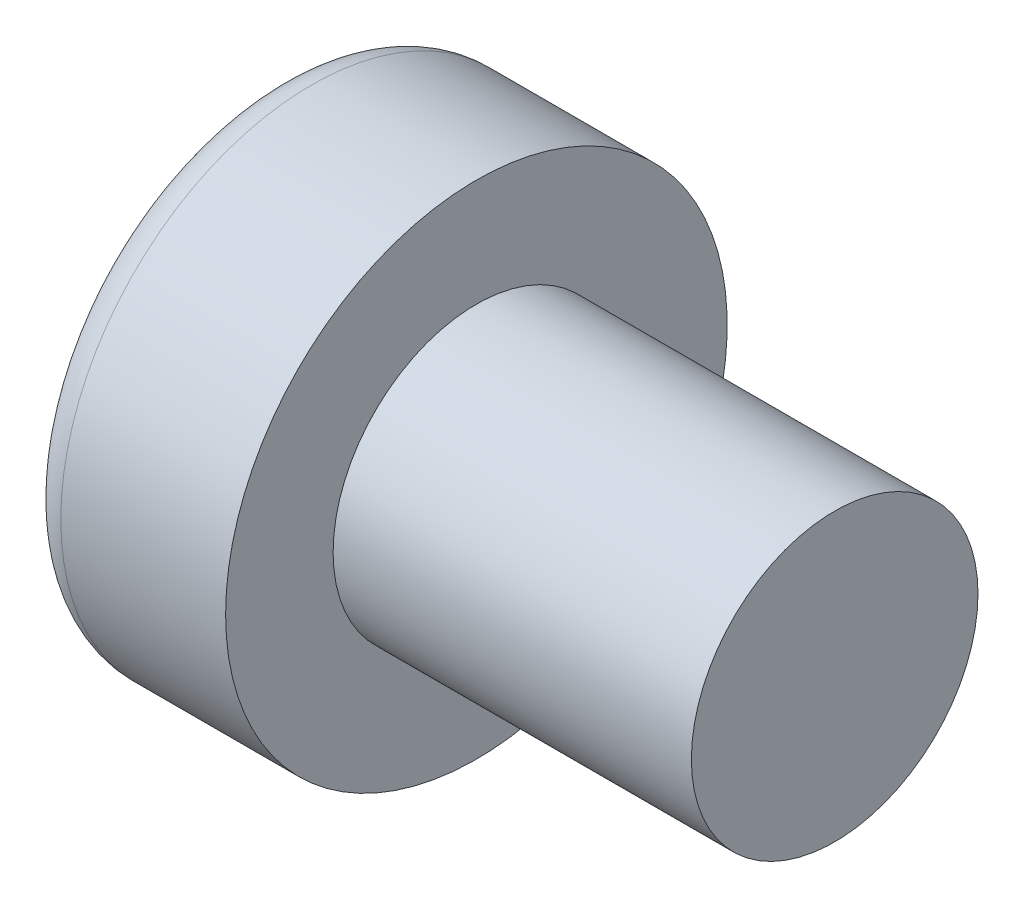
from build123d import *

# Parameters (mm, degrees)
VERRUNDUNG1_R                   = 0.5
SCHNITT_LINEAR_AUSTRAGEN1_DEPTH = 3


with BuildPart() as part:
    # Skizze1 → Rotation1 (revolve)
    with BuildSketch(Plane.XY, mode=Mode.PRIVATE) as rotation1_sk:
        Polygon((-7.8, 0), (-7.8, 3.5), (-5, 3.5), (-5, 2), (0, 2), (0, 0), align=None)
    revolve(rotation1_sk.sketch.rotate(Axis((-65.011808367, 0, 0), (1, 0, 0)), 90), axis=Axis((-65.011808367, 0, 0), (1, 0, 0)))

    # Verrundung1
    verrundung1_edges = [part.edges().sort_by_distance(p)[0] for p in [
        (-7.8, 0, -3.5),
    ]]
    fillet(verrundung1_edges, radius=VERRUNDUNG1_R)

    # Skizze2 → Schnitt-Linear austragen1 (cut)
    with BuildSketch(Plane.ZY.offset(7.8)):
        Polygon((1.25, 0.721687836), (0, 1.443375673), (-1.25, 0.721687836), (-1.25, -0.721687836), (0, -1.443375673), (1.25, -0.721687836), align=None)
    extrude(amount=-SCHNITT_LINEAR_AUSTRAGEN1_DEPTH, mode=Mode.SUBTRACT)


solid = part.part
